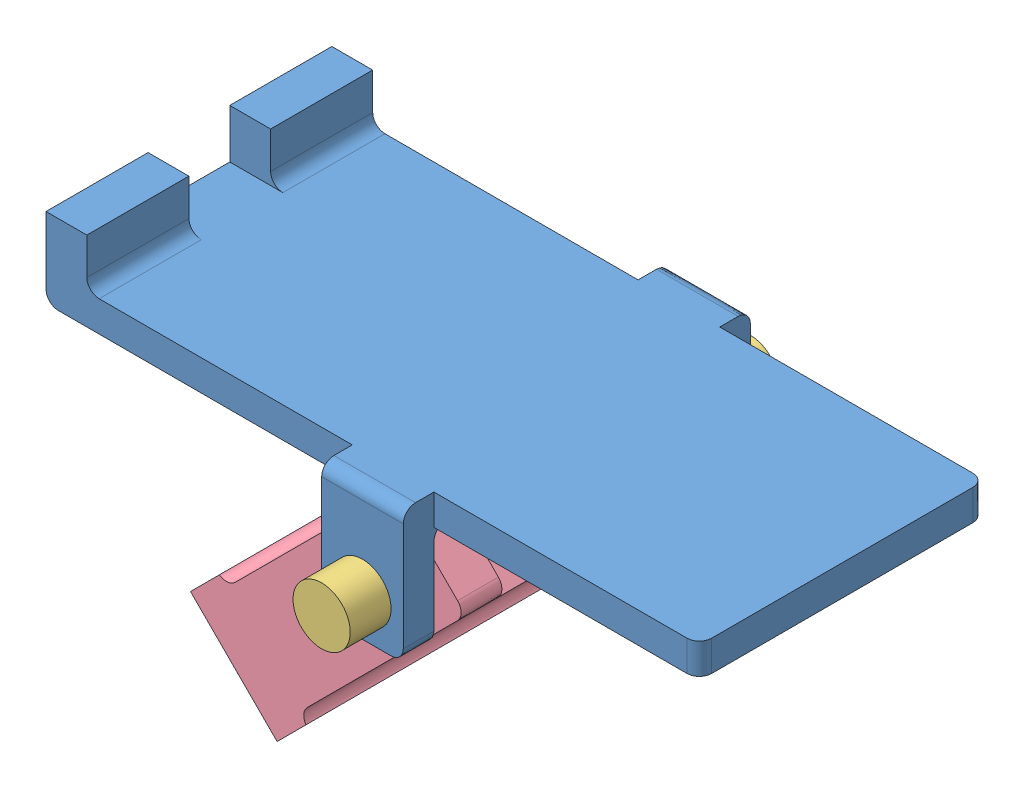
SolidWorks assembly Phone_Stand.SLDASM, configuration Default (file format 13000). Lengths in mm.
Overall size (160 86.12 105).
5 component instances, 4 part files, 9 mates.
Components (placement in the parent):
- Phone_Stand_Bed-1: Phone_Stand_Bed.SLDPRT [Default] at origin size (160 44.5 85)
- Phone_Stand_HingeAxis-1: Phone_Stand_HingeAxis.SLDPRT [Default] at (-75 -22.5 -15) x (0.336627 0.941638 0) z (0.941638 -0.336627 0) size (10 100 10)
- Phone_Stand_HingeCap-1: Phone_Stand_HingeCap.SLDPRT [Default] at (-75 -22.5 -17.5) x (0.980496 -0.196539 0) z (-0.196539 -0.980496 0) size (14 10 14)
- Phone_Stand_HingeCap-2: Phone_Stand_HingeCap.SLDPRT [Default] at (-75 -22.5 87.5) x (0.797786 -0.602941 0) z (0.602941 0.797786 0) size (14 10 14)
- Phone_Stand_Support-1: Phone_Stand_Support.SLDPRT [Default] at (-91.9706 -39.4706 2) x (0.707107 0.707107 0) z (0 0 1) size (68 30 66)
Mates (geometry in assembly coordinates):
- Concentric1: concentric anti-aligned: cylinder of Phone_Stand_Bed-1 through (-75 -22.5 -7.5) axis (0 0 1) radius 6; cylinder of Phone_Stand_HingeAxis-1 through (-75 -22.5 85) axis (0 0 -1) radius 5
- Coincident1: coincident anti-aligned: plane of Phone_Stand_HingeAxis-1 through (-75 -22.5 85) normal (0 0 1); plane of Phone_Stand_HingeCap-2 through (-75 -22.5 85) normal (0 0 -1)
- Concentric2: concentric aligned: cylinder of Phone_Stand_HingeAxis-1 through (-75 -22.5 85) axis (0 0 -1) radius 5; cylinder of Phone_Stand_HingeCap-2 through (-75 -22.5 85) axis (0 0 -1) radius 5.5
- Concentric3: concentric anti-aligned: cylinder of Phone_Stand_HingeAxis-1 through (-75 -22.5 85) axis (0 0 -1) radius 5; cylinder of Phone_Stand_Support-1 through (-75 -22.5 2) axis (0 0 1) radius 5
- Coincident2: coincident anti-aligned: plane of Phone_Stand_HingeAxis-1 through (-75 -22.5 -15) normal (0 0 -1); plane of Phone_Stand_HingeCap-1 through (-75 -22.5 -15) normal (0 0 1)
- Concentric4: concentric anti-aligned: cylinder of Phone_Stand_HingeAxis-1 through (-75 -22.5 85) axis (0 0 -1) radius 5; cylinder of Phone_Stand_HingeCap-1 through (-75 -22.5 -15) axis (0 0 1) radius 5.5
- Coincident3: coincident anti-aligned: plane of Phone_Stand_Bed-1 through (0 0 -7.5) normal (0 0 -1); plane of Phone_Stand_HingeCap-1 through (-75 -22.5 -7.5) normal (0 0 1)
- Distance1: distance = 2 mm anti-aligned: plane of Phone_Stand_Bed-1 through (-85 -32.5 70) normal (0 0 -1); plane of Phone_Stand_Support-1 through (-91.9706 -39.4706 68) normal (0 0 1)
- Angle1: planar angle = 2.356194 rad aligned: plane of Phone_Stand_Support-1 through (-126.6188 -52.9056 68) normal (-0.707107 0.707107 0); plane of Phone_Stand_Bed-1 through (-160 -7.5 70) normal (0 -1 0)
